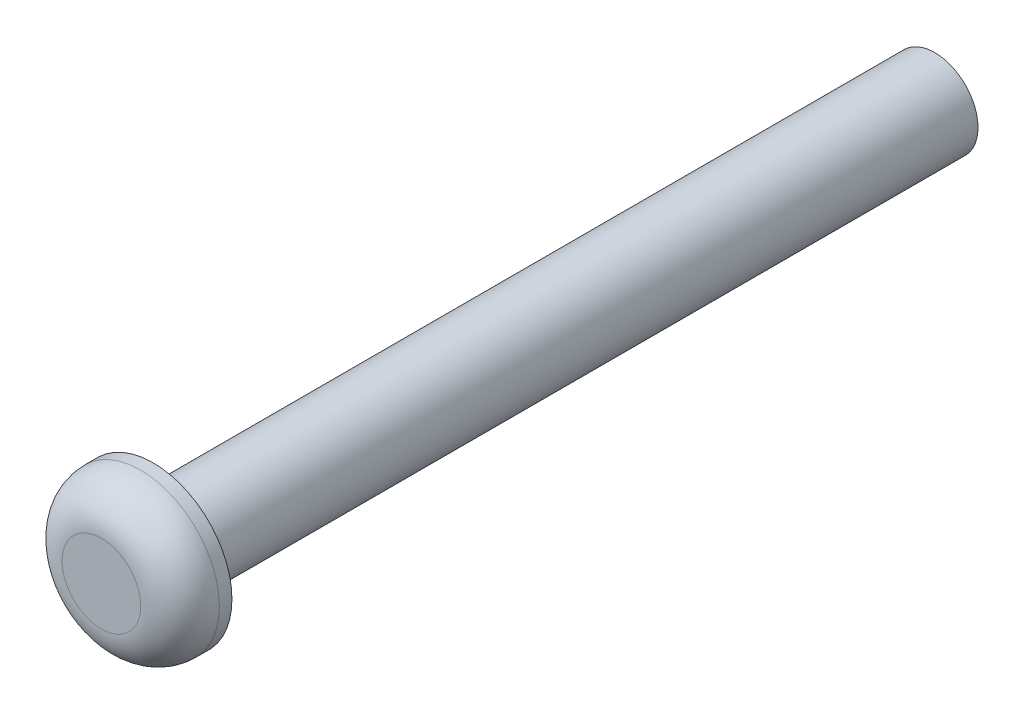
from build123d import *

# Parameters (mm, degrees)
SKETCH1_R           = 2.54
BOSS_EXTRUDE1_DEPTH = 1.6764
SKETCH3_R           = 1.397
BOSS_EXTRUDE2_DEPTH = 26.924
FILLET1_R           = 1.27


with BuildPart() as part:
    # Sketch1 → Boss-Extrude1 (new body)
    with BuildSketch(Plane.XY):
        Circle(SKETCH1_R)
    extrude(amount=BOSS_EXTRUDE1_DEPTH)

    # Sketch3 → Boss-Extrude2 (add)
    with BuildSketch(Plane.XY.offset(1.6764)):
        Circle(SKETCH3_R)
    extrude(amount=-BOSS_EXTRUDE2_DEPTH)

    # Fillet1
    fillet1_edges = [part.edges().sort_by_distance(p)[0] for p in [
        (-2.54, 0, 1.6764),
    ]]
    fillet(fillet1_edges, radius=FILLET1_R)


solid = part.part
